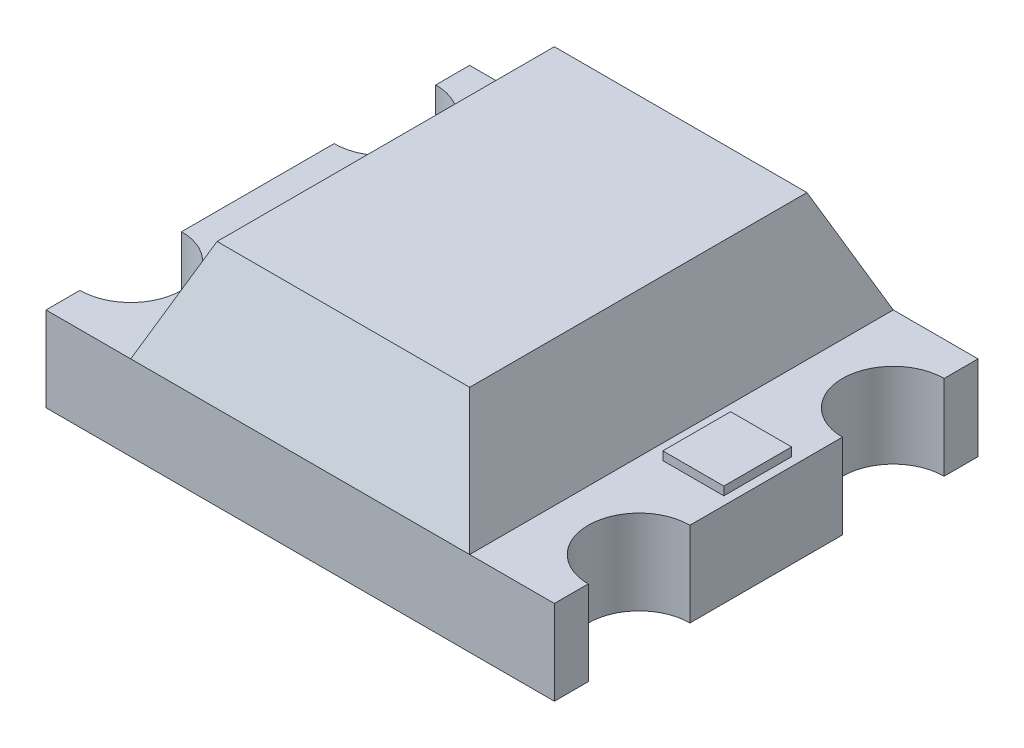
from build123d import *

# Parameters (mm, degrees)
EXTRUDE_1_DEPTH = 0.5
SKETCH_2_W      = 0.7
SKETCH_2_H      = 0.7
EXTRUDE_2_DEPTH = 0.2
SKETCH1_W       = 0.7
SKETCH1_H       = 0.7
EXTRUDE1_DEPTH  = 0.2
SKETCH2_W       = 0.36
SKETCH2_H       = 0.4
EXTRUDE2_DEPTH  = 0.05
SKETCH_3_W      = 2
SKETCH_3_H      = 2.5
EXTRUDE_4_DEPTH = 0.6
EXTRUDE_4_TAPER = 23


with BuildPart() as part:
    # Sketch 1 → Extrude 1 (new body)
    with BuildSketch(Plane(origin=(0, 0, 0), x_dir=(1, 0, 0), z_dir=(0, 1, 0))):
        with BuildLine():
            Line((-1.5, -1.25), (1.5, -1.25))
            Line((1.5, -1.25), (1.5, -1.05))
            ThreePointArc((1.5, -1.05), (1.2, -0.75), (1.5, -0.45))
            Line((1.5, -0.45), (1.5, 0.45))
            ThreePointArc((1.5, 0.45), (1.2, 0.75), (1.5, 1.05))
            Line((1.5, 1.05), (1.5, 1.25))
            Line((1.5, 1.25), (-1.5, 1.25))
            Line((-1.5, 1.25), (-1.5, 1.05))
            ThreePointArc((-1.5, 1.05), (-1.2, 0.75), (-1.5, 0.45))
            Line((-1.5, 0.45), (-1.5, -0.45))
            ThreePointArc((-1.5, -0.45), (-1.2, -0.75), (-1.5, -1.05))
            Line((-1.5, -1.05), (-1.5, -1.25))
        make_face()
    extrude(amount=EXTRUDE_1_DEPTH)

    # Sketch 2 → Extrude 2 (add)
    with BuildSketch(Plane(origin=(0, 0.5, 0), x_dir=(-1, 0, 0), z_dir=(0, 1, 0))):
        with Locations((0, 0.55)):
            Rectangle(SKETCH_2_W, SKETCH_2_H)
    extrude(amount=EXTRUDE_2_DEPTH)

    # Sketch1 → Extrude1 (add)
    with BuildSketch(Plane(origin=(0, 0.5, 0), x_dir=(1, 0, 0), z_dir=(0, 1, 0))):
        with Locations((0, 0.55)):
            Rectangle(SKETCH1_W, SKETCH1_H)
    extrude(amount=EXTRUDE1_DEPTH)

    # Sketch2 → Extrude2 (add)
    with BuildSketch(Plane(origin=(0, 0.5, 0), x_dir=(1, 0, 0), z_dir=(0, 1, 0))):
        with Locations((1.27, 0)):
            Rectangle(SKETCH2_W, SKETCH2_H)
    extrude(amount=EXTRUDE2_DEPTH)


with BuildPart() as body_2:
    # Sketch 3 → Extrude 4 (new body)
    with BuildSketch(Plane(origin=(0, 0.5, 0), x_dir=(-1, 0, 0), z_dir=(0, 1, 0))):
        Rectangle(SKETCH_3_W, SKETCH_3_H)
    extrude(amount=EXTRUDE_4_DEPTH, taper=EXTRUDE_4_TAPER)


solid = Compound([part.part, body_2.part])
